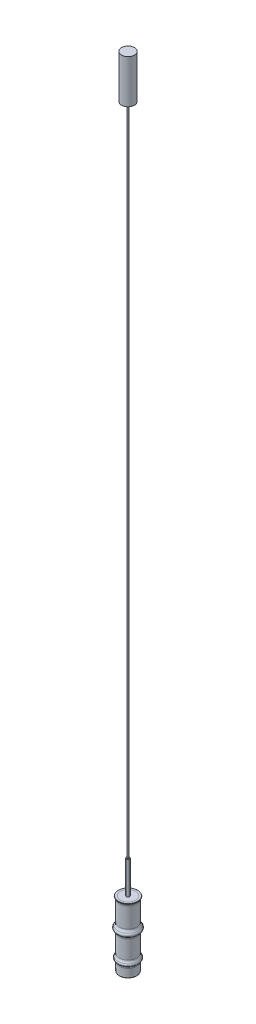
ISO-10303-21;
HEADER;
FILE_DESCRIPTION(('STEP AP214'),'2;1');
FILE_NAME('part.step','',(''),(''),'','','');
FILE_SCHEMA(('AUTOMOTIVE_DESIGN { 1 0 10303 214 1 1 1 1 }'));
ENDSEC;
DATA;
#1=APPLICATION_CONTEXT('core data for automotive mechanical design processes');
#2=APPLICATION_PROTOCOL_DEFINITION('international standard','automotive_design',2000,#1);
#3=PRODUCT_CONTEXT('',#1,'mechanical');
#4=PRODUCT('Part','Part','',(#3));
#5=PRODUCT_RELATED_PRODUCT_CATEGORY('part','',(#4));
#6=PRODUCT_DEFINITION_FORMATION('','',#4);
#7=PRODUCT_DEFINITION_CONTEXT('part definition',#1,'design');
#8=PRODUCT_DEFINITION('design','',#6,#7);
#9=PRODUCT_DEFINITION_SHAPE('','',#8);
#10=(LENGTH_UNIT() NAMED_UNIT(*) SI_UNIT(.MILLI.,.METRE.));
#11=(NAMED_UNIT(*) PLANE_ANGLE_UNIT() SI_UNIT($,.RADIAN.));
#12=(NAMED_UNIT(*) SI_UNIT($,.STERADIAN.) SOLID_ANGLE_UNIT());
#13=UNCERTAINTY_MEASURE_WITH_UNIT(LENGTH_MEASURE(1.E-05),#10,'distance_accuracy_value','');
#14=(GEOMETRIC_REPRESENTATION_CONTEXT(3) GLOBAL_UNCERTAINTY_ASSIGNED_CONTEXT((#13)) GLOBAL_UNIT_ASSIGNED_CONTEXT((#10,
#11,#12)) REPRESENTATION_CONTEXT('',''));
#15=CARTESIAN_POINT('',(0.,0.,0.));
#16=DIRECTION('',(0.,0.,1.));
#17=DIRECTION('',(1.,0.,0.));
#18=AXIS2_PLACEMENT_3D('',#15,#16,#17);
#19=CARTESIAN_POINT('',(100.,3776.5,0.));
#20=DIRECTION('',(0.,-1.,0.));
#21=DIRECTION('',(0.,0.,-1.));
#22=AXIS2_PLACEMENT_3D('',#19,#20,#21);
#23=CYLINDRICAL_SURFACE('',#22,30.);
#24=CARTESIAN_POINT('',(100.,3776.5,0.));
#25=DIRECTION('',(0.,1.,0.));
#26=DIRECTION('',(0.,0.,1.));
#27=AXIS2_PLACEMENT_3D('',#24,#25,#26);
#28=CIRCLE('',#27,30.);
#29=CARTESIAN_POINT('',(100.,3776.5,30.));
#30=VERTEX_POINT('',#29);
#31=EDGE_CURVE('E12',#30,#30,#28,.T.);
#32=ORIENTED_EDGE('',*,*,#31,.F.);
#33=EDGE_LOOP('',(#32));
#34=FACE_BOUND('',#33,.T.);
#35=CARTESIAN_POINT('',(100.,3576.5,0.));
#36=DIRECTION('',(0.,1.,0.));
#37=DIRECTION('',(0.,0.,1.));
#38=AXIS2_PLACEMENT_3D('',#35,#36,#37);
#39=CIRCLE('',#38,30.);
#40=CARTESIAN_POINT('',(100.,3576.5,30.));
#41=VERTEX_POINT('',#40);
#42=EDGE_CURVE('E59',#41,#41,#39,.T.);
#43=ORIENTED_EDGE('',*,*,#42,.T.);
#44=EDGE_LOOP('',(#43));
#45=FACE_BOUND('',#44,.T.);
#46=ADVANCED_FACE('F56',(#34,#45),#23,.T.);
#47=CARTESIAN_POINT('',(100.,3776.5,0.));
#48=DIRECTION('',(0.,1.,0.));
#49=DIRECTION('',(0.,0.,1.));
#50=AXIS2_PLACEMENT_3D('',#47,#48,#49);
#51=PLANE('',#50);
#52=ORIENTED_EDGE('',*,*,#31,.T.);
#53=EDGE_LOOP('',(#52));
#54=FACE_BOUND('',#53,.T.);
#55=ADVANCED_FACE('F71',(#54),#51,.T.);
#56=CARTESIAN_POINT('',(100.,3576.5,0.));
#57=DIRECTION('',(0.,1.,0.));
#58=DIRECTION('',(0.,0.,1.));
#59=AXIS2_PLACEMENT_3D('',#56,#57,#58);
#60=PLANE('',#59);
#61=ORIENTED_EDGE('',*,*,#42,.F.);
#62=EDGE_LOOP('',(#61));
#63=FACE_BOUND('',#62,.T.);
#64=ADVANCED_FACE('F69',(#63),#60,.F.);
#65=CLOSED_SHELL('',(#46,#55,#64));
#66=MANIFOLD_SOLID_BREP('B2',#65);
#67=CARTESIAN_POINT('',(100.,3576.5,0.));
#68=DIRECTION('',(0.,-1.,0.));
#69=DIRECTION('',(0.,0.,-1.));
#70=AXIS2_PLACEMENT_3D('',#67,#68,#69);
#71=CYLINDRICAL_SURFACE('',#70,7.50000000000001);
#72=CARTESIAN_POINT('',(100.,3576.5,0.));
#73=DIRECTION('',(0.,1.,0.));
#74=DIRECTION('',(0.,0.,1.));
#75=AXIS2_PLACEMENT_3D('',#72,#73,#74);
#76=CIRCLE('',#75,7.50000000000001);
#77=CARTESIAN_POINT('',(100.,3576.5,7.50000000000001));
#78=VERTEX_POINT('',#77);
#79=EDGE_CURVE('E55',#78,#78,#76,.T.);
#80=ORIENTED_EDGE('',*,*,#79,.F.);
#81=EDGE_LOOP('',(#80));
#82=FACE_BOUND('',#81,.T.);
#83=CARTESIAN_POINT('',(100.,3561.5,0.));
#84=DIRECTION('',(0.,1.,0.));
#85=DIRECTION('',(0.,0.,1.));
#86=AXIS2_PLACEMENT_3D('',#83,#84,#85);
#87=CIRCLE('',#86,7.50000000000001);
#88=CARTESIAN_POINT('',(100.,3561.5,7.50000000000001));
#89=VERTEX_POINT('',#88);
#90=EDGE_CURVE('E108',#89,#89,#87,.T.);
#91=ORIENTED_EDGE('',*,*,#90,.T.);
#92=EDGE_LOOP('',(#91));
#93=FACE_BOUND('',#92,.T.);
#94=ADVANCED_FACE('F105',(#82,#93),#71,.T.);
#95=CARTESIAN_POINT('',(100.,3576.5,0.));
#96=DIRECTION('',(0.,1.,0.));
#97=DIRECTION('',(0.,0.,1.));
#98=AXIS2_PLACEMENT_3D('',#95,#96,#97);
#99=PLANE('',#98);
#100=ORIENTED_EDGE('',*,*,#79,.T.);
#101=EDGE_LOOP('',(#100));
#102=FACE_BOUND('',#101,.T.);
#103=ADVANCED_FACE('F120',(#102),#99,.T.);
#104=CARTESIAN_POINT('',(100.,3561.5,0.));
#105=DIRECTION('',(0.,1.,0.));
#106=DIRECTION('',(0.,0.,1.));
#107=AXIS2_PLACEMENT_3D('',#104,#105,#106);
#108=PLANE('',#107);
#109=ORIENTED_EDGE('',*,*,#90,.F.);
#110=EDGE_LOOP('',(#109));
#111=FACE_BOUND('',#110,.T.);
#112=ADVANCED_FACE('F118',(#111),#108,.F.);
#113=CLOSED_SHELL('',(#94,#103,#112));
#114=MANIFOLD_SOLID_BREP('B7',#113);
#115=CARTESIAN_POINT('',(100.,3561.5,0.));
#116=DIRECTION('',(0.,-1.,0.));
#117=DIRECTION('',(0.,0.,-1.));
#118=AXIS2_PLACEMENT_3D('',#115,#116,#117);
#119=CYLINDRICAL_SURFACE('',#118,3.50000000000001);
#120=CARTESIAN_POINT('',(100.,3561.5,0.));
#121=DIRECTION('',(0.,1.,0.));
#122=DIRECTION('',(0.,0.,1.));
#123=AXIS2_PLACEMENT_3D('',#120,#121,#122);
#124=CIRCLE('',#123,3.50000000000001);
#125=CARTESIAN_POINT('',(100.,3561.5,3.50000000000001));
#126=VERTEX_POINT('',#125);
#127=EDGE_CURVE('E104',#126,#126,#124,.T.);
#128=ORIENTED_EDGE('',*,*,#127,.F.);
#129=EDGE_LOOP('',(#128));
#130=FACE_BOUND('',#129,.T.);
#131=CARTESIAN_POINT('',(100.,561.5,0.));
#132=DIRECTION('',(0.,1.,0.));
#133=DIRECTION('',(0.,0.,1.));
#134=AXIS2_PLACEMENT_3D('',#131,#132,#133);
#135=CIRCLE('',#134,3.50000000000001);
#136=CARTESIAN_POINT('',(100.,561.5,3.50000000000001));
#137=VERTEX_POINT('',#136);
#138=EDGE_CURVE('E157',#137,#137,#135,.T.);
#139=ORIENTED_EDGE('',*,*,#138,.T.);
#140=EDGE_LOOP('',(#139));
#141=FACE_BOUND('',#140,.T.);
#142=ADVANCED_FACE('F154',(#130,#141),#119,.T.);
#143=CARTESIAN_POINT('',(100.,3561.5,0.));
#144=DIRECTION('',(0.,1.,0.));
#145=DIRECTION('',(0.,0.,1.));
#146=AXIS2_PLACEMENT_3D('',#143,#144,#145);
#147=PLANE('',#146);
#148=ORIENTED_EDGE('',*,*,#127,.T.);
#149=EDGE_LOOP('',(#148));
#150=FACE_BOUND('',#149,.T.);
#151=ADVANCED_FACE('F169',(#150),#147,.T.);
#152=CARTESIAN_POINT('',(100.,561.5,0.));
#153=DIRECTION('',(0.,1.,0.));
#154=DIRECTION('',(0.,0.,1.));
#155=AXIS2_PLACEMENT_3D('',#152,#153,#154);
#156=PLANE('',#155);
#157=ORIENTED_EDGE('',*,*,#138,.F.);
#158=EDGE_LOOP('',(#157));
#159=FACE_BOUND('',#158,.T.);
#160=ADVANCED_FACE('F167',(#159),#156,.F.);
#161=CLOSED_SHELL('',(#142,#151,#160));
#162=MANIFOLD_SOLID_BREP('B50',#161);
#163=CARTESIAN_POINT('',(100.,561.5,0.));
#164=DIRECTION('',(0.,-1.,0.));
#165=DIRECTION('',(0.,0.,-1.));
#166=AXIS2_PLACEMENT_3D('',#163,#164,#165);
#167=CYLINDRICAL_SURFACE('',#166,7.50000000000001);
#168=CARTESIAN_POINT('',(100.,561.5,0.));
#169=DIRECTION('',(0.,1.,0.));
#170=DIRECTION('',(0.,0.,1.));
#171=AXIS2_PLACEMENT_3D('',#168,#169,#170);
#172=CIRCLE('',#171,7.50000000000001);
#173=CARTESIAN_POINT('',(100.,561.5,7.50000000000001));
#174=VERTEX_POINT('',#173);
#175=EDGE_CURVE('E153',#174,#174,#172,.T.);
#176=ORIENTED_EDGE('',*,*,#175,.F.);
#177=EDGE_LOOP('',(#176));
#178=FACE_BOUND('',#177,.T.);
#179=CARTESIAN_POINT('',(100.,411.5,0.));
#180=DIRECTION('',(0.,1.,0.));
#181=DIRECTION('',(0.,0.,1.));
#182=AXIS2_PLACEMENT_3D('',#179,#180,#181);
#183=CIRCLE('',#182,7.50000000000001);
#184=CARTESIAN_POINT('',(100.,411.5,7.50000000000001));
#185=VERTEX_POINT('',#184);
#186=EDGE_CURVE('E206',#185,#185,#183,.T.);
#187=ORIENTED_EDGE('',*,*,#186,.T.);
#188=EDGE_LOOP('',(#187));
#189=FACE_BOUND('',#188,.T.);
#190=ADVANCED_FACE('F203',(#178,#189),#167,.T.);
#191=CARTESIAN_POINT('',(100.,561.5,0.));
#192=DIRECTION('',(0.,1.,0.));
#193=DIRECTION('',(0.,0.,1.));
#194=AXIS2_PLACEMENT_3D('',#191,#192,#193);
#195=PLANE('',#194);
#196=ORIENTED_EDGE('',*,*,#175,.T.);
#197=EDGE_LOOP('',(#196));
#198=FACE_BOUND('',#197,.T.);
#199=ADVANCED_FACE('F218',(#198),#195,.T.);
#200=CARTESIAN_POINT('',(100.,411.5,0.));
#201=DIRECTION('',(0.,1.,0.));
#202=DIRECTION('',(0.,0.,1.));
#203=AXIS2_PLACEMENT_3D('',#200,#201,#202);
#204=PLANE('',#203);
#205=ORIENTED_EDGE('',*,*,#186,.F.);
#206=EDGE_LOOP('',(#205));
#207=FACE_BOUND('',#206,.T.);
#208=ADVANCED_FACE('F216',(#207),#204,.F.);
#209=CLOSED_SHELL('',(#190,#199,#208));
#210=MANIFOLD_SOLID_BREP('B99',#209);
#211=CARTESIAN_POINT('',(100.,408.5,0.));
#212=DIRECTION('',(0.,1.,0.));
#213=DIRECTION('',(0.,0.,1.));
#214=AXIS2_PLACEMENT_3D('',#211,#212,#213);
#215=CYLINDRICAL_SURFACE('',#214,35.0000000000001);
#216=CARTESIAN_POINT('',(100.,408.5,0.));
#217=DIRECTION('',(0.,1.,0.));
#218=DIRECTION('',(0.,0.,1.));
#219=AXIS2_PLACEMENT_3D('',#216,#217,#218);
#220=CIRCLE('',#219,35.0000000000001);
#221=CARTESIAN_POINT('',(100.,408.5,35.0000000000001));
#222=VERTEX_POINT('',#221);
#223=EDGE_CURVE('E202',#222,#222,#220,.T.);
#224=ORIENTED_EDGE('',*,*,#223,.T.);
#225=EDGE_LOOP('',(#224));
#226=FACE_BOUND('',#225,.T.);
#227=CARTESIAN_POINT('',(100.,411.5,0.));
#228=DIRECTION('',(0.,1.,0.));
#229=DIRECTION('',(0.,0.,1.));
#230=AXIS2_PLACEMENT_3D('',#227,#228,#229);
#231=CIRCLE('',#230,35.0000000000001);
#232=CARTESIAN_POINT('',(100.,411.5,35.0000000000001));
#233=VERTEX_POINT('',#232);
#234=EDGE_CURVE('E255',#233,#233,#231,.T.);
#235=ORIENTED_EDGE('',*,*,#234,.F.);
#236=EDGE_LOOP('',(#235));
#237=FACE_BOUND('',#236,.T.);
#238=ADVANCED_FACE('F252',(#226,#237),#215,.T.);
#239=CARTESIAN_POINT('',(100.,408.5,0.));
#240=DIRECTION('',(0.,1.,0.));
#241=DIRECTION('',(0.,0.,1.));
#242=AXIS2_PLACEMENT_3D('',#239,#240,#241);
#243=PLANE('',#242);
#244=ORIENTED_EDGE('',*,*,#223,.F.);
#245=EDGE_LOOP('',(#244));
#246=FACE_BOUND('',#245,.T.);
#247=ADVANCED_FACE('F267',(#246),#243,.F.);
#248=CARTESIAN_POINT('',(100.,411.5,0.));
#249=DIRECTION('',(0.,1.,0.));
#250=DIRECTION('',(0.,0.,1.));
#251=AXIS2_PLACEMENT_3D('',#248,#249,#250);
#252=PLANE('',#251);
#253=ORIENTED_EDGE('',*,*,#234,.T.);
#254=EDGE_LOOP('',(#253));
#255=FACE_BOUND('',#254,.T.);
#256=ADVANCED_FACE('F264',(#255),#252,.T.);
#257=CLOSED_SHELL('',(#238,#247,#256));
#258=MANIFOLD_SOLID_BREP('B148',#257);
#259=CARTESIAN_POINT('',(99.9999999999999,393.,0.));
#260=DIRECTION('',(0.,-1.,0.));
#261=DIRECTION('',(0.,0.,-1.));
#262=AXIS2_PLACEMENT_3D('',#259,#260,#261);
#263=PLANE('',#262);
#264=CARTESIAN_POINT('',(99.9999999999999,393.,0.));
#265=DIRECTION('',(0.,-1.,0.));
#266=DIRECTION('',(0.,0.,-1.));
#267=AXIS2_PLACEMENT_3D('',#264,#265,#266);
#268=CIRCLE('',#267,30.);
#269=CARTESIAN_POINT('',(99.9999999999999,393.,-30.));
#270=VERTEX_POINT('',#269);
#271=EDGE_CURVE('E307',#270,#270,#268,.T.);
#272=ORIENTED_EDGE('',*,*,#271,.F.);
#273=EDGE_LOOP('',(#272));
#274=FACE_BOUND('',#273,.T.);
#275=ADVANCED_FACE('F300',(#274),#263,.F.);
#276=CARTESIAN_POINT('',(99.9999999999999,45.1471862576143,0.));
#277=DIRECTION('',(0.,1.,0.));
#278=DIRECTION('',(0.,0.,1.));
#279=AXIS2_PLACEMENT_3D('',#276,#277,#278);
#280=CYLINDRICAL_SURFACE('',#279,30.);
#281=CARTESIAN_POINT('',(99.9999999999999,130.,0.));
#282=DIRECTION('',(0.,1.,0.));
#283=DIRECTION('',(-1.,0.,0.));
#284=AXIS2_PLACEMENT_3D('',#281,#282,#283);
#285=CIRCLE('',#284,30.);
#286=CARTESIAN_POINT('',(69.9999999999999,130.,0.));
#287=VERTEX_POINT('',#286);
#288=EDGE_CURVE('E251',#287,#287,#285,.T.);
#289=ORIENTED_EDGE('',*,*,#288,.T.);
#290=EDGE_LOOP('',(#289));
#291=FACE_BOUND('',#290,.T.);
#292=ORIENTED_EDGE('',*,*,#271,.T.);
#293=EDGE_LOOP('',(#292));
#294=FACE_BOUND('',#293,.T.);
#295=ADVANCED_FACE('F302',(#291,#294),#280,.T.);
#296=CARTESIAN_POINT('',(100.,130.,0.));
#297=DIRECTION('',(0.,1.,0.));
#298=DIRECTION('',(-1.,0.,0.));
#299=AXIS2_PLACEMENT_3D('',#296,#297,#298);
#300=PLANE('',#299);
#301=ORIENTED_EDGE('',*,*,#288,.F.);
#302=EDGE_LOOP('',(#301));
#303=FACE_BOUND('',#302,.T.);
#304=ADVANCED_FACE('F318',(#303),#300,.F.);
#305=CLOSED_SHELL('',(#275,#295,#304));
#306=MANIFOLD_SOLID_BREP('B197',#305);
#307=CARTESIAN_POINT('',(135.,111.5,0.));
#308=DIRECTION('',(0.,-1.,0.));
#309=DIRECTION('',(0.,0.,-1.));
#310=AXIS2_PLACEMENT_3D('',#307,#308,#309);
#311=PLANE('',#310);
#312=CARTESIAN_POINT('',(100.,111.5,0.));
#313=DIRECTION('',(0.,-1.,0.));
#314=DIRECTION('',(0.,0.,-1.));
#315=AXIS2_PLACEMENT_3D('',#312,#313,#314);
#316=CIRCLE('',#315,39.0000000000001);
#317=CARTESIAN_POINT('',(100.,111.5,-39.0000000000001));
#318=VERTEX_POINT('',#317);
#319=EDGE_CURVE('E356',#318,#318,#316,.T.);
#320=ORIENTED_EDGE('',*,*,#319,.T.);
#321=EDGE_LOOP('',(#320));
#322=FACE_BOUND('',#321,.T.);
#323=CARTESIAN_POINT('',(100.,111.5,0.));
#324=DIRECTION('',(0.,-1.,0.));
#325=DIRECTION('',(0.,0.,-1.));
#326=AXIS2_PLACEMENT_3D('',#323,#324,#325);
#327=CIRCLE('',#326,35.0000000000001);
#328=CARTESIAN_POINT('',(100.,111.5,-35.0000000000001));
#329=VERTEX_POINT('',#328);
#330=EDGE_CURVE('E394',#329,#329,#327,.T.);
#331=ORIENTED_EDGE('',*,*,#330,.F.);
#332=EDGE_LOOP('',(#331));
#333=FACE_BOUND('',#332,.T.);
#334=ADVANCED_FACE('F341',(#322,#333),#311,.T.);
#335=CARTESIAN_POINT('',(100.,130.,0.));
#336=DIRECTION('',(0.,-1.,0.));
#337=DIRECTION('',(0.,0.,-1.));
#338=AXIS2_PLACEMENT_3D('',#335,#336,#337);
#339=CYLINDRICAL_SURFACE('',#338,40.0000000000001);
#340=CARTESIAN_POINT('',(100.,112.5,0.));
#341=DIRECTION('',(0.,-1.,0.));
#342=DIRECTION('',(0.,0.,-1.));
#343=AXIS2_PLACEMENT_3D('',#340,#341,#342);
#344=CIRCLE('',#343,40.0000000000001);
#345=CARTESIAN_POINT('',(100.,112.5,-40.0000000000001));
#346=VERTEX_POINT('',#345);
#347=EDGE_CURVE('E352',#346,#346,#344,.F.);
#348=ORIENTED_EDGE('',*,*,#347,.T.);
#349=EDGE_LOOP('',(#348));
#350=FACE_BOUND('',#349,.T.);
#351=CARTESIAN_POINT('',(100.,149.729490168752,0.));
#352=DIRECTION('',(0.,-1.,0.));
#353=DIRECTION('',(0.,0.,-1.));
#354=AXIS2_PLACEMENT_3D('',#351,#352,#353);
#355=CIRCLE('',#354,40.0000000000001);
#356=CARTESIAN_POINT('',(100.,149.729490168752,-40.0000000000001));
#357=VERTEX_POINT('',#356);
#358=EDGE_CURVE('E361',#357,#357,#355,.T.);
#359=ORIENTED_EDGE('',*,*,#358,.T.);
#360=EDGE_LOOP('',(#359));
#361=FACE_BOUND('',#360,.T.);
#362=ADVANCED_FACE('F402',(#350,#361),#339,.T.);
#363=CARTESIAN_POINT('',(100.,166.5,0.));
#364=DIRECTION('',(0.,-1.,0.));
#365=DIRECTION('',(0.,0.,-1.));
#366=AXIS2_PLACEMENT_3D('',#363,#364,#365);
#367=TOROIDAL_SURFACE('',#366,40.0000000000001,7.50000000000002);
#368=CARTESIAN_POINT('',(100.,172.09016994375,0.));
#369=DIRECTION('',(0.,-1.,0.));
#370=DIRECTION('',(0.,0.,-1.));
#371=AXIS2_PLACEMENT_3D('',#368,#369,#370);
#372=CIRCLE('',#371,45.0000000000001);
#373=CARTESIAN_POINT('',(100.,172.09016994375,-45.0000000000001));
#374=VERTEX_POINT('',#373);
#375=EDGE_CURVE('E385',#374,#374,#372,.T.);
#376=ORIENTED_EDGE('',*,*,#375,.T.);
#377=EDGE_LOOP('',(#376));
#378=FACE_BOUND('',#377,.T.);
#379=CARTESIAN_POINT('',(100.,160.909830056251,0.));
#380=DIRECTION('',(0.,1.,0.));
#381=DIRECTION('',(0.,0.,1.));
#382=AXIS2_PLACEMENT_3D('',#379,#380,#381);
#383=CIRCLE('',#382,45.0000000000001);
#384=CARTESIAN_POINT('',(100.,160.909830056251,45.0000000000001));
#385=VERTEX_POINT('',#384);
#386=EDGE_CURVE('E388',#385,#385,#383,.T.);
#387=ORIENTED_EDGE('',*,*,#386,.T.);
#388=EDGE_LOOP('',(#387));
#389=FACE_BOUND('',#388,.T.);
#390=ADVANCED_FACE('F408',(#378,#389),#367,.T.);
#391=CARTESIAN_POINT('',(100.,130.,0.));
#392=DIRECTION('',(0.,-1.,0.));
#393=DIRECTION('',(0.,0.,-1.));
#394=AXIS2_PLACEMENT_3D('',#391,#392,#393);
#395=CYLINDRICAL_SURFACE('',#394,40.0000000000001);
#396=CARTESIAN_POINT('',(100.,183.270509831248,0.));
#397=DIRECTION('',(0.,-1.,0.));
#398=DIRECTION('',(0.,0.,-1.));
#399=AXIS2_PLACEMENT_3D('',#396,#397,#398);
#400=CIRCLE('',#399,40.0000000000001);
#401=CARTESIAN_POINT('',(100.,183.270509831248,-40.0000000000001));
#402=VERTEX_POINT('',#401);
#403=EDGE_CURVE('E379',#402,#402,#400,.F.);
#404=ORIENTED_EDGE('',*,*,#403,.T.);
#405=EDGE_LOOP('',(#404));
#406=FACE_BOUND('',#405,.T.);
#407=CARTESIAN_POINT('',(100.,266.5,0.));
#408=DIRECTION('',(0.,-1.,0.));
#409=DIRECTION('',(0.,0.,-1.));
#410=AXIS2_PLACEMENT_3D('',#407,#408,#409);
#411=CIRCLE('',#410,40.0000000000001);
#412=CARTESIAN_POINT('',(100.,266.5,-40.0000000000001));
#413=VERTEX_POINT('',#412);
#414=EDGE_CURVE('E382',#413,#413,#411,.T.);
#415=ORIENTED_EDGE('',*,*,#414,.T.);
#416=EDGE_LOOP('',(#415));
#417=FACE_BOUND('',#416,.T.);
#418=ADVANCED_FACE('F534',(#406,#417),#395,.T.);
#419=CARTESIAN_POINT('',(100.,286.5,0.));
#420=DIRECTION('',(0.,-1.,0.));
#421=DIRECTION('',(0.,0.,-1.));
#422=AXIS2_PLACEMENT_3D('',#419,#420,#421);
#423=TOROIDAL_SURFACE('',#422,40.0000000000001,10.);
#424=CARTESIAN_POINT('',(100.,278.5,0.));
#425=DIRECTION('',(0.,1.,0.));
#426=DIRECTION('',(0.,0.,1.));
#427=AXIS2_PLACEMENT_3D('',#424,#425,#426);
#428=CIRCLE('',#427,46.0000000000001);
#429=CARTESIAN_POINT('',(100.,278.5,46.0000000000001));
#430=VERTEX_POINT('',#429);
#431=EDGE_CURVE('E373',#430,#430,#428,.T.);
#432=ORIENTED_EDGE('',*,*,#431,.T.);
#433=EDGE_LOOP('',(#432));
#434=FACE_BOUND('',#433,.T.);
#435=CARTESIAN_POINT('',(100.,294.5,0.));
#436=DIRECTION('',(0.,-1.,0.));
#437=DIRECTION('',(0.,0.,-1.));
#438=AXIS2_PLACEMENT_3D('',#435,#436,#437);
#439=CIRCLE('',#438,46.0000000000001);
#440=CARTESIAN_POINT('',(100.,294.5,-46.0000000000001));
#441=VERTEX_POINT('',#440);
#442=EDGE_CURVE('E376',#441,#441,#439,.T.);
#443=ORIENTED_EDGE('',*,*,#442,.T.);
#444=EDGE_LOOP('',(#443));
#445=FACE_BOUND('',#444,.T.);
#446=ADVANCED_FACE('F524',(#434,#445),#423,.T.);
#447=CARTESIAN_POINT('',(100.,130.,0.));
#448=DIRECTION('',(0.,-1.,0.));
#449=DIRECTION('',(0.,0.,-1.));
#450=AXIS2_PLACEMENT_3D('',#447,#448,#449);
#451=CYLINDRICAL_SURFACE('',#450,40.0000000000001);
#452=CARTESIAN_POINT('',(100.,306.5,0.));
#453=DIRECTION('',(0.,-1.,0.));
#454=DIRECTION('',(0.,0.,-1.));
#455=AXIS2_PLACEMENT_3D('',#452,#453,#454);
#456=CIRCLE('',#455,40.0000000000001);
#457=CARTESIAN_POINT('',(100.,306.5,-40.0000000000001));
#458=VERTEX_POINT('',#457);
#459=EDGE_CURVE('E367',#458,#458,#456,.F.);
#460=ORIENTED_EDGE('',*,*,#459,.T.);
#461=EDGE_LOOP('',(#460));
#462=FACE_BOUND('',#461,.T.);
#463=CARTESIAN_POINT('',(100.,398.271243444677,0.));
#464=DIRECTION('',(0.,-1.,0.));
#465=DIRECTION('',(0.,0.,-1.));
#466=AXIS2_PLACEMENT_3D('',#463,#464,#465);
#467=CIRCLE('',#466,40.0000000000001);
#468=CARTESIAN_POINT('',(100.,398.271243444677,-40.0000000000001));
#469=VERTEX_POINT('',#468);
#470=EDGE_CURVE('E370',#469,#469,#467,.T.);
#471=ORIENTED_EDGE('',*,*,#470,.T.);
#472=EDGE_LOOP('',(#471));
#473=FACE_BOUND('',#472,.T.);
#474=ADVANCED_FACE('F474',(#462,#473),#451,.T.);
#475=CARTESIAN_POINT('',(100.,411.5,0.));
#476=DIRECTION('',(0.,-1.,0.));
#477=DIRECTION('',(0.,0.,-1.));
#478=AXIS2_PLACEMENT_3D('',#475,#476,#477);
#479=TOROIDAL_SURFACE('',#478,40.0000000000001,5.);
#480=CARTESIAN_POINT('',(100.,410.25,0.));
#481=DIRECTION('',(0.,1.,0.));
#482=DIRECTION('',(0.,0.,1.));
#483=AXIS2_PLACEMENT_3D('',#480,#481,#482);
#484=CIRCLE('',#483,44.8412291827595);
#485=CARTESIAN_POINT('',(100.,410.25,44.8412291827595));
#486=VERTEX_POINT('',#485);
#487=EDGE_CURVE('E348',#486,#486,#484,.F.);
#488=ORIENTED_EDGE('',*,*,#487,.T.);
#489=EDGE_LOOP('',(#488));
#490=FACE_BOUND('',#489,.T.);
#491=CARTESIAN_POINT('',(100.,408.192810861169,0.));
#492=DIRECTION('',(0.,1.,0.));
#493=DIRECTION('',(0.,0.,1.));
#494=AXIS2_PLACEMENT_3D('',#491,#492,#493);
#495=CIRCLE('',#494,43.7500000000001);
#496=CARTESIAN_POINT('',(100.,408.192810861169,43.7500000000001));
#497=VERTEX_POINT('',#496);
#498=EDGE_CURVE('E364',#497,#497,#495,.T.);
#499=ORIENTED_EDGE('',*,*,#498,.T.);
#500=EDGE_LOOP('',(#499));
#501=FACE_BOUND('',#500,.T.);
#502=ADVANCED_FACE('F463',(#490,#501),#479,.T.);
#503=CARTESIAN_POINT('',(135.,411.5,0.));
#504=DIRECTION('',(0.,1.,0.));
#505=DIRECTION('',(0.,0.,1.));
#506=AXIS2_PLACEMENT_3D('',#503,#504,#505);
#507=PLANE('',#506);
#508=CARTESIAN_POINT('',(100.,411.5,0.));
#509=DIRECTION('',(0.,1.,0.));
#510=DIRECTION('',(0.,0.,1.));
#511=AXIS2_PLACEMENT_3D('',#508,#509,#510);
#512=CIRCLE('',#511,43.8729833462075);
#513=CARTESIAN_POINT('',(100.,411.5,43.8729833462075));
#514=VERTEX_POINT('',#513);
#515=EDGE_CURVE('E299',#514,#514,#512,.T.);
#516=ORIENTED_EDGE('',*,*,#515,.T.);
#517=EDGE_LOOP('',(#516));
#518=FACE_BOUND('',#517,.T.);
#519=CARTESIAN_POINT('',(100.,411.5,0.));
#520=DIRECTION('',(0.,-1.,0.));
#521=DIRECTION('',(0.,0.,-1.));
#522=AXIS2_PLACEMENT_3D('',#519,#520,#521);
#523=CIRCLE('',#522,35.0000000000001);
#524=CARTESIAN_POINT('',(100.,411.5,-35.0000000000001));
#525=VERTEX_POINT('',#524);
#526=EDGE_CURVE('E391',#525,#525,#523,.T.);
#527=ORIENTED_EDGE('',*,*,#526,.T.);
#528=EDGE_LOOP('',(#527));
#529=FACE_BOUND('',#528,.T.);
#530=ADVANCED_FACE('F458',(#518,#529),#507,.T.);
#531=CARTESIAN_POINT('',(100.,130.,0.));
#532=DIRECTION('',(0.,-1.,0.));
#533=DIRECTION('',(0.,0.,-1.));
#534=AXIS2_PLACEMENT_3D('',#531,#532,#533);
#535=CYLINDRICAL_SURFACE('',#534,35.0000000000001);
#536=ORIENTED_EDGE('',*,*,#330,.T.);
#537=EDGE_LOOP('',(#536));
#538=FACE_BOUND('',#537,.T.);
#539=ORIENTED_EDGE('',*,*,#526,.F.);
#540=EDGE_LOOP('',(#539));
#541=FACE_BOUND('',#540,.T.);
#542=ADVANCED_FACE('F398',(#538,#541),#535,.F.);
#543=CARTESIAN_POINT('',(100.,183.270509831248,0.));
#544=DIRECTION('',(0.,-1.,0.));
#545=DIRECTION('',(0.,0.,-1.));
#546=AXIS2_PLACEMENT_3D('',#543,#544,#545);
#547=TOROIDAL_SURFACE('',#546,55.0000000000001,15.);
#548=ORIENTED_EDGE('',*,*,#403,.F.);
#549=EDGE_LOOP('',(#548));
#550=FACE_BOUND('',#549,.T.);
#551=ORIENTED_EDGE('',*,*,#375,.F.);
#552=EDGE_LOOP('',(#551));
#553=FACE_BOUND('',#552,.T.);
#554=ADVANCED_FACE('F413',(#550,#553),#547,.F.);
#555=CARTESIAN_POINT('',(100.,266.5,0.));
#556=DIRECTION('',(0.,-1.,0.));
#557=DIRECTION('',(0.,0.,-1.));
#558=AXIS2_PLACEMENT_3D('',#555,#556,#557);
#559=TOROIDAL_SURFACE('',#558,55.0000000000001,15.);
#560=ORIENTED_EDGE('',*,*,#431,.F.);
#561=EDGE_LOOP('',(#560));
#562=FACE_BOUND('',#561,.T.);
#563=ORIENTED_EDGE('',*,*,#414,.F.);
#564=EDGE_LOOP('',(#563));
#565=FACE_BOUND('',#564,.T.);
#566=ADVANCED_FACE('F416',(#562,#565),#559,.F.);
#567=CARTESIAN_POINT('',(100.,306.5,0.));
#568=DIRECTION('',(0.,-1.,0.));
#569=DIRECTION('',(0.,0.,-1.));
#570=AXIS2_PLACEMENT_3D('',#567,#568,#569);
#571=TOROIDAL_SURFACE('',#570,55.0000000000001,15.);
#572=ORIENTED_EDGE('',*,*,#459,.F.);
#573=EDGE_LOOP('',(#572));
#574=FACE_BOUND('',#573,.T.);
#575=ORIENTED_EDGE('',*,*,#442,.F.);
#576=EDGE_LOOP('',(#575));
#577=FACE_BOUND('',#576,.T.);
#578=ADVANCED_FACE('F420',(#574,#577),#571,.F.);
#579=CARTESIAN_POINT('',(100.,398.271243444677,0.));
#580=DIRECTION('',(0.,-1.,0.));
#581=DIRECTION('',(0.,0.,-1.));
#582=AXIS2_PLACEMENT_3D('',#579,#580,#581);
#583=TOROIDAL_SURFACE('',#582,55.0000000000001,15.);
#584=ORIENTED_EDGE('',*,*,#498,.F.);
#585=EDGE_LOOP('',(#584));
#586=FACE_BOUND('',#585,.T.);
#587=ORIENTED_EDGE('',*,*,#470,.F.);
#588=EDGE_LOOP('',(#587));
#589=FACE_BOUND('',#588,.T.);
#590=ADVANCED_FACE('F424',(#586,#589),#583,.F.);
#591=CARTESIAN_POINT('',(100.,149.729490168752,0.));
#592=DIRECTION('',(0.,-1.,0.));
#593=DIRECTION('',(0.,0.,-1.));
#594=AXIS2_PLACEMENT_3D('',#591,#592,#593);
#595=TOROIDAL_SURFACE('',#594,55.0000000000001,15.);
#596=ORIENTED_EDGE('',*,*,#386,.F.);
#597=EDGE_LOOP('',(#596));
#598=FACE_BOUND('',#597,.T.);
#599=ORIENTED_EDGE('',*,*,#358,.F.);
#600=EDGE_LOOP('',(#599));
#601=FACE_BOUND('',#600,.T.);
#602=ADVANCED_FACE('F428',(#598,#601),#595,.F.);
#603=CARTESIAN_POINT('',(100.,112.5,0.));
#604=DIRECTION('',(0.,-1.,0.));
#605=DIRECTION('',(0.,0.,-1.));
#606=AXIS2_PLACEMENT_3D('',#603,#604,#605);
#607=TOROIDAL_SURFACE('',#606,39.0000000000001,1.);
#608=ORIENTED_EDGE('',*,*,#347,.F.);
#609=EDGE_LOOP('',(#608));
#610=FACE_BOUND('',#609,.T.);
#611=ORIENTED_EDGE('',*,*,#319,.F.);
#612=EDGE_LOOP('',(#611));
#613=FACE_BOUND('',#612,.T.);
#614=ADVANCED_FACE('F431',(#610,#613),#607,.T.);
#615=CARTESIAN_POINT('',(100.,410.5,0.));
#616=DIRECTION('',(0.,1.,0.));
#617=DIRECTION('',(0.,0.,1.));
#618=AXIS2_PLACEMENT_3D('',#615,#616,#617);
#619=TOROIDAL_SURFACE('',#618,43.8729833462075,1.);
#620=ORIENTED_EDGE('',*,*,#515,.F.);
#621=EDGE_LOOP('',(#620));
#622=FACE_BOUND('',#621,.T.);
#623=ORIENTED_EDGE('',*,*,#487,.F.);
#624=EDGE_LOOP('',(#623));
#625=FACE_BOUND('',#624,.T.);
#626=ADVANCED_FACE('F343',(#622,#625),#619,.T.);
#627=CLOSED_SHELL('',(#334,#362,#390,#418,#446,#474,#502,#530,#542,#554,#566,#578,#590,#602,
#614,#626));
#628=MANIFOLD_SOLID_BREP('B246',#627);
#629=ADVANCED_BREP_SHAPE_REPRESENTATION('',(#18,#66,#114,#162,#210,#258,#306,#628),#14);
#630=SHAPE_DEFINITION_REPRESENTATION(#9,#629);
ENDSEC;
END-ISO-10303-21;
